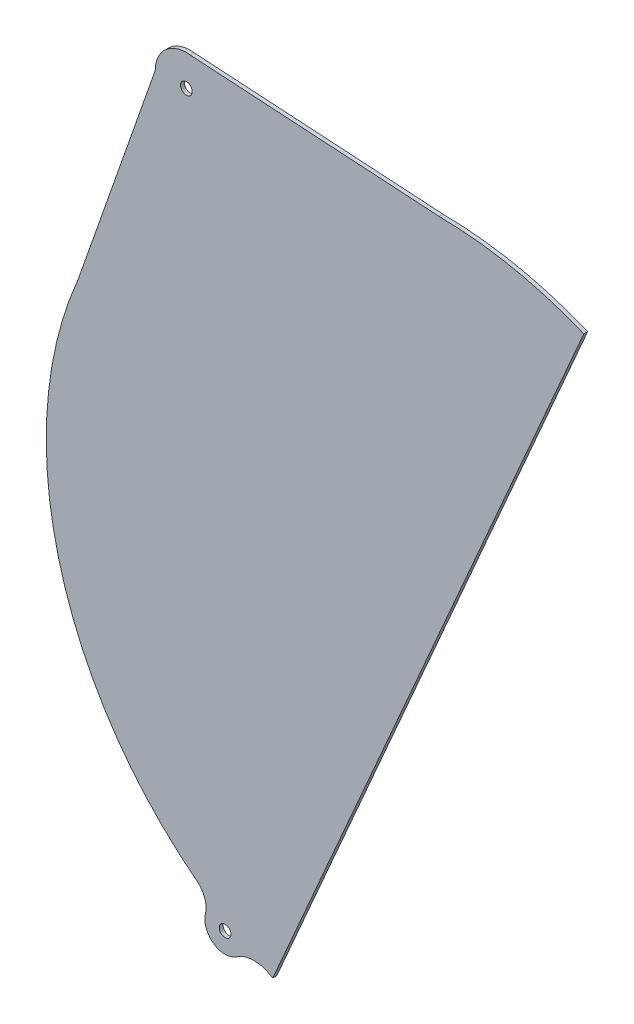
from build123d import *

# Parameters (mm, degrees)
SKETCH1_R           = 4.7625
BOSS_EXTRUDE1_DEPTH = 3.175
SKETCH6_W           = 3.175
SKETCH6_H           = 635
CUT_EXTRUDE1_DEPTH  = 6.35


with BuildPart() as part:
    # Sketch1 → Boss-Extrude1 (new body)
    with BuildSketch(Plane.XY):
        with BuildLine():
            Line((-126.889709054, -291.041666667), (0, 0))
            Line((0, 0), (126.889709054, 291.041666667))
            ThreePointArc((126.889709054, 291.041666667), (66.272585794, 310.506351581), (2.990713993, 317.485914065))
            Line((2.990713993, 317.485914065), (-200.079446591, 330.00758113))
            ThreePointArc((-200.079446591, 330.00758113), (-220.021087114, 323.831842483), (-228.6, 304.8))
            Line((-228.6, 304.8), (-291.270360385, 126.363868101))
            ThreePointArc((-291.270360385, 126.363868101), (-307.478803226, -79.139342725), (-194.071360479, -251.281827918))
            ThreePointArc((-194.071360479, -251.281827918), (-188.116042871, -260.145466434), (-187.675030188, -270.814833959))
            ThreePointArc((-187.675030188, -270.814833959), (-180.942501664, -288.262628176), (-162.240857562, -288.231463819))
            ThreePointArc((-162.240857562, -288.231463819), (-148.672199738, -283.787831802), (-134.867290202, -287.431842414))
            ThreePointArc((-134.867290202, -287.431842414), (-130.890944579, -289.264257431), (-126.889709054, -291.041666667))
        make_face()
        with Locations((-171.614353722, -274.64037594)):
            Circle(SKETCH1_R, mode=Mode.SUBTRACT)
        with Locations((-203.2, 304.8)):
            Circle(SKETCH1_R, mode=Mode.SUBTRACT)
    extrude(amount=BOSS_EXTRUDE1_DEPTH)

    # Sketch6 → Cut-Extrude1 (cut)
    with BuildSketch(Plane(origin=(0, 0, 0), x_dir=(0, 0, -1), z_dir=(0.9166666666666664, -0.39965262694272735, 0))):
        with Locations((-1.5875, 0)):
            Rectangle(SKETCH6_W, SKETCH6_H)
    extrude(amount=-CUT_EXTRUDE1_DEPTH, mode=Mode.SUBTRACT)


solid = part.part
